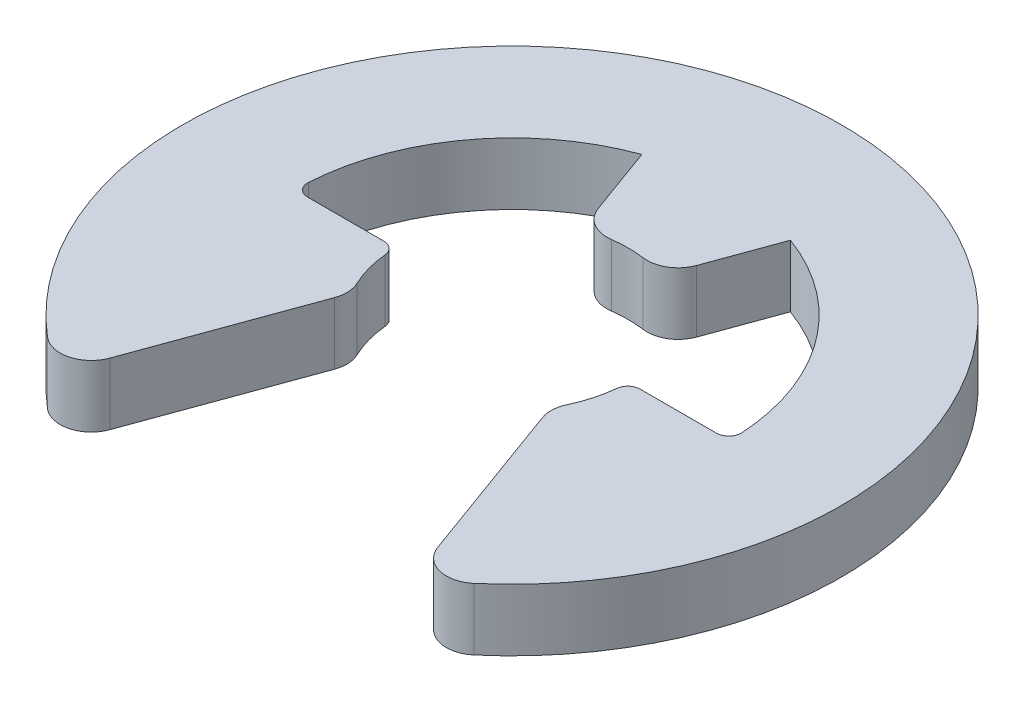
ISO-10303-21;
HEADER;
FILE_DESCRIPTION(('STEP AP214'),'2;1');
FILE_NAME('part.step','',(''),(''),'','','');
FILE_SCHEMA(('AUTOMOTIVE_DESIGN { 1 0 10303 214 1 1 1 1 }'));
ENDSEC;
DATA;
#1=APPLICATION_CONTEXT('core data for automotive mechanical design processes');
#2=APPLICATION_PROTOCOL_DEFINITION('international standard','automotive_design',2000,#1);
#3=PRODUCT_CONTEXT('',#1,'mechanical');
#4=PRODUCT('Part','Part','',(#3));
#5=PRODUCT_RELATED_PRODUCT_CATEGORY('part','',(#4));
#6=PRODUCT_DEFINITION_FORMATION('','',#4);
#7=PRODUCT_DEFINITION_CONTEXT('part definition',#1,'design');
#8=PRODUCT_DEFINITION('design','',#6,#7);
#9=PRODUCT_DEFINITION_SHAPE('','',#8);
#10=(LENGTH_UNIT() NAMED_UNIT(*) SI_UNIT(.MILLI.,.METRE.));
#11=(NAMED_UNIT(*) PLANE_ANGLE_UNIT() SI_UNIT($,.RADIAN.));
#12=(NAMED_UNIT(*) SI_UNIT($,.STERADIAN.) SOLID_ANGLE_UNIT());
#13=UNCERTAINTY_MEASURE_WITH_UNIT(LENGTH_MEASURE(1.E-05),#10,'distance_accuracy_value','');
#14=(GEOMETRIC_REPRESENTATION_CONTEXT(3) GLOBAL_UNCERTAINTY_ASSIGNED_CONTEXT((#13)) GLOBAL_UNIT_ASSIGNED_CONTEXT((#10,
#11,#12)) REPRESENTATION_CONTEXT('',''));
#15=CARTESIAN_POINT('',(0.,0.,0.));
#16=DIRECTION('',(0.,0.,1.));
#17=DIRECTION('',(1.,0.,0.));
#18=AXIS2_PLACEMENT_3D('',#15,#16,#17);
#19=CARTESIAN_POINT('',(0.,0.2,0.));
#20=DIRECTION('',(0.,-1.,0.));
#21=DIRECTION('',(0.,0.,-1.));
#22=AXIS2_PLACEMENT_3D('',#19,#20,#21);
#23=CYLINDRICAL_SURFACE('',#22,1.4);
#24=CARTESIAN_POINT('',(0.,0.2,0.));
#25=DIRECTION('',(0.,-1.,0.));
#26=DIRECTION('',(0.,0.,1.));
#27=AXIS2_PLACEMENT_3D('',#24,#25,#26);
#28=CIRCLE('',#27,1.4);
#29=CARTESIAN_POINT('',(-1.39742646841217,0.2,-0.0848484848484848));
#30=VERTEX_POINT('',#29);
#31=CARTESIAN_POINT('',(-0.478828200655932,0.2,-1.31556966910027));
#32=VERTEX_POINT('',#31);
#33=EDGE_CURVE('E187',#30,#32,#28,.T.);
#34=ORIENTED_EDGE('',*,*,#33,.F.);
#35=DIRECTION('',(0.,-1.,0.));
#36=VECTOR('',#35,1.);
#37=CARTESIAN_POINT('',(-1.39742646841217,0.2,-0.0848484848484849));
#38=LINE('',#37,#36);
#39=CARTESIAN_POINT('',(-1.39742646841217,-0.2,-0.0848484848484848));
#40=VERTEX_POINT('',#39);
#41=EDGE_CURVE('E327',#30,#40,#38,.T.);
#42=ORIENTED_EDGE('',*,*,#41,.T.);
#43=CARTESIAN_POINT('',(0.,-0.2,0.));
#44=DIRECTION('',(0.,-1.,0.));
#45=DIRECTION('',(0.,0.,1.));
#46=AXIS2_PLACEMENT_3D('',#43,#44,#45);
#47=CIRCLE('',#46,1.4);
#48=CARTESIAN_POINT('',(-0.478828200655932,-0.2,-1.31556966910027));
#49=VERTEX_POINT('',#48);
#50=EDGE_CURVE('E211',#40,#49,#47,.T.);
#51=ORIENTED_EDGE('',*,*,#50,.T.);
#52=DIRECTION('',(0.,-1.,0.));
#53=VECTOR('',#52,1.);
#54=CARTESIAN_POINT('',(-0.478828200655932,0.2,-1.31556966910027));
#55=LINE('',#54,#53);
#56=EDGE_CURVE('E204',#32,#49,#55,.T.);
#57=ORIENTED_EDGE('',*,*,#56,.F.);
#58=EDGE_LOOP('',(#34,#42,#51,#57));
#59=FACE_BOUND('',#58,.T.);
#60=ADVANCED_FACE('F39',(#59),#23,.F.);
#61=CARTESIAN_POINT('',(-0.478828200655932,0.2,-1.31556966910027));
#62=DIRECTION('',(0.939692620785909,0.,-0.342020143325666));
#63=DIRECTION('',(-0.342020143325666,0.,-0.939692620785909));
#64=AXIS2_PLACEMENT_3D('',#61,#62,#63);
#65=PLANE('',#64);
#66=DIRECTION('',(0.342020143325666,0.,0.939692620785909));
#67=VECTOR('',#66,1.);
#68=CARTESIAN_POINT('',(-0.478828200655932,-0.2,-1.31556966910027));
#69=LINE('',#68,#67);
#70=CARTESIAN_POINT('',(-0.31763711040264,-0.2,-0.872700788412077));
#71=VERTEX_POINT('',#70);
#72=EDGE_CURVE('E446',#49,#71,#69,.T.);
#73=ORIENTED_EDGE('',*,*,#72,.T.);
#74=DIRECTION('',(0.,-1.,0.));
#75=VECTOR('',#74,1.);
#76=CARTESIAN_POINT('',(-0.31763711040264,0.2,-0.872700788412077));
#77=LINE('',#76,#75);
#78=CARTESIAN_POINT('',(-0.31763711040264,0.2,-0.872700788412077));
#79=VERTEX_POINT('',#78);
#80=EDGE_CURVE('E206',#71,#79,#77,.F.);
#81=ORIENTED_EDGE('',*,*,#80,.T.);
#82=DIRECTION('',(0.342020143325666,0.,0.939692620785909));
#83=VECTOR('',#82,1.);
#84=CARTESIAN_POINT('',(-0.478828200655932,0.2,-1.31556966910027));
#85=LINE('',#84,#83);
#86=EDGE_CURVE('E191',#32,#79,#85,.T.);
#87=ORIENTED_EDGE('',*,*,#86,.F.);
#88=ORIENTED_EDGE('',*,*,#56,.T.);
#89=EDGE_LOOP('',(#73,#81,#87,#88));
#90=FACE_BOUND('',#89,.T.);
#91=ADVANCED_FACE('F203',(#90),#65,.F.);
#92=CARTESIAN_POINT('',(0.,0.2,0.));
#93=DIRECTION('',(0.,-1.,0.));
#94=DIRECTION('',(0.,0.,-1.));
#95=AXIS2_PLACEMENT_3D('',#92,#93,#94);
#96=CYLINDRICAL_SURFACE('',#95,0.75);
#97=CARTESIAN_POINT('',(0.,-0.2,0.));
#98=DIRECTION('',(0.,-1.,0.));
#99=DIRECTION('',(0.,0.,1.));
#100=AXIS2_PLACEMENT_3D('',#97,#98,#99);
#101=CIRCLE('',#100,0.75);
#102=CARTESIAN_POINT('',(-0.102393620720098,-0.2,-0.742977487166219));
#103=VERTEX_POINT('',#102);
#104=CARTESIAN_POINT('',(0.102393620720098,-0.2,-0.742977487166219));
#105=VERTEX_POINT('',#104);
#106=EDGE_CURVE('E449',#103,#105,#101,.T.);
#107=ORIENTED_EDGE('',*,*,#106,.T.);
#108=DIRECTION('',(0.,-1.,0.));
#109=VECTOR('',#108,1.);
#110=CARTESIAN_POINT('',(0.102393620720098,0.2,-0.742977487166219));
#111=LINE('',#110,#109);
#112=CARTESIAN_POINT('',(0.102393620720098,0.2,-0.742977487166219));
#113=VERTEX_POINT('',#112);
#114=EDGE_CURVE('E290',#105,#113,#111,.F.);
#115=ORIENTED_EDGE('',*,*,#114,.T.);
#116=CARTESIAN_POINT('',(0.,0.2,0.));
#117=DIRECTION('',(0.,-1.,0.));
#118=DIRECTION('',(0.,0.,1.));
#119=AXIS2_PLACEMENT_3D('',#116,#117,#118);
#120=CIRCLE('',#119,0.75);
#121=CARTESIAN_POINT('',(-0.102393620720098,0.2,-0.742977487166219));
#122=VERTEX_POINT('',#121);
#123=EDGE_CURVE('E208',#122,#113,#120,.T.);
#124=ORIENTED_EDGE('',*,*,#123,.F.);
#125=DIRECTION('',(0.,-1.,0.));
#126=VECTOR('',#125,1.);
#127=CARTESIAN_POINT('',(-0.102393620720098,0.2,-0.742977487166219));
#128=LINE('',#127,#126);
#129=EDGE_CURVE('E286',#122,#103,#128,.T.);
#130=ORIENTED_EDGE('',*,*,#129,.T.);
#131=EDGE_LOOP('',(#107,#115,#124,#130));
#132=FACE_BOUND('',#131,.T.);
#133=ADVANCED_FACE('F370',(#132),#96,.F.);
#134=CARTESIAN_POINT('',(0.256515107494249,0.2,-0.704769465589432));
#135=DIRECTION('',(-0.93969262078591,0.,-0.342020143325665));
#136=DIRECTION('',(-0.342020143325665,0.,0.93969262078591));
#137=AXIS2_PLACEMENT_3D('',#134,#135,#136);
#138=PLANE('',#137);
#139=DIRECTION('',(0.342020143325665,0.,-0.93969262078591));
#140=VECTOR('',#139,1.);
#141=CARTESIAN_POINT('',(0.256515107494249,0.2,-0.704769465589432));
#142=LINE('',#141,#140);
#143=CARTESIAN_POINT('',(0.31763711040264,0.2,-0.872700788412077));
#144=VERTEX_POINT('',#143);
#145=CARTESIAN_POINT('',(0.478828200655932,0.2,-1.31556966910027));
#146=VERTEX_POINT('',#145);
#147=EDGE_CURVE('E423',#144,#146,#142,.T.);
#148=ORIENTED_EDGE('',*,*,#147,.F.);
#149=DIRECTION('',(0.,-1.,0.));
#150=VECTOR('',#149,1.);
#151=CARTESIAN_POINT('',(0.31763711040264,0.2,-0.872700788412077));
#152=LINE('',#151,#150);
#153=CARTESIAN_POINT('',(0.31763711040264,-0.2,-0.872700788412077));
#154=VERTEX_POINT('',#153);
#155=EDGE_CURVE('E282',#144,#154,#152,.T.);
#156=ORIENTED_EDGE('',*,*,#155,.T.);
#157=DIRECTION('',(0.342020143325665,0.,-0.93969262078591));
#158=VECTOR('',#157,1.);
#159=CARTESIAN_POINT('',(0.256515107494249,-0.2,-0.704769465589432));
#160=LINE('',#159,#158);
#161=CARTESIAN_POINT('',(0.478828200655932,-0.2,-1.31556966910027));
#162=VERTEX_POINT('',#161);
#163=EDGE_CURVE('E453',#154,#162,#160,.T.);
#164=ORIENTED_EDGE('',*,*,#163,.T.);
#165=DIRECTION('',(0.,-1.,0.));
#166=VECTOR('',#165,1.);
#167=CARTESIAN_POINT('',(0.478828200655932,0.2,-1.31556966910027));
#168=LINE('',#167,#166);
#169=EDGE_CURVE('E215',#146,#162,#168,.T.);
#170=ORIENTED_EDGE('',*,*,#169,.F.);
#171=EDGE_LOOP('',(#148,#156,#164,#170));
#172=FACE_BOUND('',#171,.T.);
#173=ADVANCED_FACE('F527',(#172),#138,.F.);
#174=CARTESIAN_POINT('',(0.,0.2,0.));
#175=DIRECTION('',(0.,-1.,0.));
#176=DIRECTION('',(0.,0.,-1.));
#177=AXIS2_PLACEMENT_3D('',#174,#175,#176);
#178=CYLINDRICAL_SURFACE('',#177,1.4);
#179=CARTESIAN_POINT('',(0.,-0.2,0.));
#180=DIRECTION('',(0.,-1.,0.));
#181=DIRECTION('',(0.,0.,1.));
#182=AXIS2_PLACEMENT_3D('',#179,#180,#181);
#183=CIRCLE('',#182,1.4);
#184=CARTESIAN_POINT('',(1.39742646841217,-0.2,-0.0848484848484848));
#185=VERTEX_POINT('',#184);
#186=EDGE_CURVE('E456',#162,#185,#183,.T.);
#187=ORIENTED_EDGE('',*,*,#186,.T.);
#188=DIRECTION('',(0.,-1.,0.));
#189=VECTOR('',#188,1.);
#190=CARTESIAN_POINT('',(1.39742646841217,0.2,-0.0848484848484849));
#191=LINE('',#190,#189);
#192=CARTESIAN_POINT('',(1.39742646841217,0.2,-0.0848484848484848));
#193=VERTEX_POINT('',#192);
#194=EDGE_CURVE('E309',#185,#193,#191,.F.);
#195=ORIENTED_EDGE('',*,*,#194,.T.);
#196=CARTESIAN_POINT('',(0.,0.2,0.));
#197=DIRECTION('',(0.,-1.,0.));
#198=DIRECTION('',(0.,0.,1.));
#199=AXIS2_PLACEMENT_3D('',#196,#197,#198);
#200=CIRCLE('',#199,1.4);
#201=EDGE_CURVE('E410',#146,#193,#200,.T.);
#202=ORIENTED_EDGE('',*,*,#201,.F.);
#203=ORIENTED_EDGE('',*,*,#169,.T.);
#204=EDGE_LOOP('',(#187,#195,#202,#203));
#205=FACE_BOUND('',#204,.T.);
#206=ADVANCED_FACE('F521',(#205),#178,.F.);
#207=CARTESIAN_POINT('',(0.75,0.2,0.));
#208=DIRECTION('',(0.,0.,1.));
#209=DIRECTION('',(1.,0.,0.));
#210=AXIS2_PLACEMENT_3D('',#207,#208,#209);
#211=PLANE('',#210);
#212=DIRECTION('',(-1.,0.,0.));
#213=VECTOR('',#212,1.);
#214=CARTESIAN_POINT('',(0.75,0.2,0.));
#215=LINE('',#214,#213);
#216=CARTESIAN_POINT('',(1.31757352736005,0.2,0.));
#217=VERTEX_POINT('',#216);
#218=CARTESIAN_POINT('',(0.826135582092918,0.2,0.));
#219=VERTEX_POINT('',#218);
#220=EDGE_CURVE('E407',#217,#219,#215,.T.);
#221=ORIENTED_EDGE('',*,*,#220,.F.);
#222=DIRECTION('',(0.,1.,0.));
#223=VECTOR('',#222,1.);
#224=CARTESIAN_POINT('',(1.31757352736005,-0.2,0.));
#225=LINE('',#224,#223);
#226=CARTESIAN_POINT('',(1.31757352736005,-0.2,0.));
#227=VERTEX_POINT('',#226);
#228=EDGE_CURVE('E305',#217,#227,#225,.F.);
#229=ORIENTED_EDGE('',*,*,#228,.T.);
#230=DIRECTION('',(-1.,0.,0.));
#231=VECTOR('',#230,1.);
#232=CARTESIAN_POINT('',(0.75,-0.2,0.));
#233=LINE('',#232,#231);
#234=CARTESIAN_POINT('',(0.826135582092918,-0.2,0.));
#235=VERTEX_POINT('',#234);
#236=EDGE_CURVE('E460',#227,#235,#233,.T.);
#237=ORIENTED_EDGE('',*,*,#236,.T.);
#238=DIRECTION('',(0.,-1.,0.));
#239=VECTOR('',#238,1.);
#240=CARTESIAN_POINT('',(0.826135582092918,0.2,0.));
#241=LINE('',#240,#239);
#242=EDGE_CURVE('E302',#235,#219,#241,.F.);
#243=ORIENTED_EDGE('',*,*,#242,.T.);
#244=EDGE_LOOP('',(#221,#229,#237,#243));
#245=FACE_BOUND('',#244,.T.);
#246=ADVANCED_FACE('F412',(#245),#211,.F.);
#247=CARTESIAN_POINT('',(0.,0.2,0.));
#248=DIRECTION('',(0.,-1.,0.));
#249=DIRECTION('',(0.,0.,-1.));
#250=AXIS2_PLACEMENT_3D('',#247,#248,#249);
#251=CYLINDRICAL_SURFACE('',#250,0.750000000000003);
#252=CARTESIAN_POINT('',(0.,0.2,0.));
#253=DIRECTION('',(0.,-1.,0.));
#254=DIRECTION('',(0.,0.,1.));
#255=AXIS2_PLACEMENT_3D('',#252,#253,#254);
#256=CIRCLE('',#255,0.750000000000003);
#257=CARTESIAN_POINT('',(0.746508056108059,0.2,0.072289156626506));
#258=VERTEX_POINT('',#257);
#259=CARTESIAN_POINT('',(0.677796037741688,0.2,0.321080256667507));
#260=VERTEX_POINT('',#259);
#261=EDGE_CURVE('E417',#258,#260,#256,.T.);
#262=ORIENTED_EDGE('',*,*,#261,.F.);
#263=DIRECTION('',(0.,-1.,0.));
#264=VECTOR('',#263,1.);
#265=CARTESIAN_POINT('',(0.746508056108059,0.2,0.072289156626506));
#266=LINE('',#265,#264);
#267=CARTESIAN_POINT('',(0.746508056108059,-0.2,0.072289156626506));
#268=VERTEX_POINT('',#267);
#269=EDGE_CURVE('E312',#258,#268,#266,.T.);
#270=ORIENTED_EDGE('',*,*,#269,.T.);
#271=CARTESIAN_POINT('',(0.,-0.2,0.));
#272=DIRECTION('',(0.,-1.,0.));
#273=DIRECTION('',(0.,0.,1.));
#274=AXIS2_PLACEMENT_3D('',#271,#272,#273);
#275=CIRCLE('',#274,0.750000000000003);
#276=CARTESIAN_POINT('',(0.677796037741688,-0.2,0.321080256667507));
#277=VERTEX_POINT('',#276);
#278=EDGE_CURVE('E463',#268,#277,#275,.T.);
#279=ORIENTED_EDGE('',*,*,#278,.T.);
#280=DIRECTION('',(0.,-1.,0.));
#281=VECTOR('',#280,1.);
#282=CARTESIAN_POINT('',(0.677796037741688,0.2,0.321080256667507));
#283=LINE('',#282,#281);
#284=EDGE_CURVE('E250',#277,#260,#283,.F.);
#285=ORIENTED_EDGE('',*,*,#284,.T.);
#286=EDGE_LOOP('',(#262,#270,#279,#285));
#287=FACE_BOUND('',#286,.T.);
#288=ADVANCED_FACE('F512',(#287),#251,.F.);
#289=CARTESIAN_POINT('',(0.639999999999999,0.2,0.391024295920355));
#290=DIRECTION('',(0.939692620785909,0.,-0.342020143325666));
#291=DIRECTION('',(-0.342020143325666,0.,-0.939692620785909));
#292=AXIS2_PLACEMENT_3D('',#289,#290,#291);
#293=PLANE('',#292);
#294=DIRECTION('',(0.342020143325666,0.,0.939692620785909));
#295=VECTOR('',#294,1.);
#296=CARTESIAN_POINT('',(0.639999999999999,0.2,0.391024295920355));
#297=LINE('',#296,#295);
#298=CARTESIAN_POINT('',(0.670603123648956,0.2,0.475105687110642));
#299=VERTEX_POINT('',#298);
#300=CARTESIAN_POINT('',(1.05698051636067,0.2,1.53666884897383));
#301=VERTEX_POINT('',#300);
#302=EDGE_CURVE('E420',#299,#301,#297,.T.);
#303=ORIENTED_EDGE('',*,*,#302,.F.);
#304=DIRECTION('',(0.,-1.,0.));
#305=VECTOR('',#304,1.);
#306=CARTESIAN_POINT('',(0.670603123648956,0.2,0.475105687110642));
#307=LINE('',#306,#305);
#308=CARTESIAN_POINT('',(0.670603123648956,-0.2,0.475105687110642));
#309=VERTEX_POINT('',#308);
#310=EDGE_CURVE('E220',#299,#309,#307,.T.);
#311=ORIENTED_EDGE('',*,*,#310,.T.);
#312=DIRECTION('',(0.342020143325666,0.,0.939692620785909));
#313=VECTOR('',#312,1.);
#314=CARTESIAN_POINT('',(0.639999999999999,-0.2,0.391024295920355));
#315=LINE('',#314,#313);
#316=CARTESIAN_POINT('',(1.05698051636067,-0.2,1.53666884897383));
#317=VERTEX_POINT('',#316);
#318=EDGE_CURVE('E466',#309,#317,#315,.T.);
#319=ORIENTED_EDGE('',*,*,#318,.T.);
#320=DIRECTION('',(0.,-1.,0.));
#321=VECTOR('',#320,1.);
#322=CARTESIAN_POINT('',(1.05698051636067,0.2,1.53666884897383));
#323=LINE('',#322,#321);
#324=EDGE_CURVE('E214',#317,#301,#323,.F.);
#325=ORIENTED_EDGE('',*,*,#324,.T.);
#326=EDGE_LOOP('',(#303,#311,#319,#325));
#327=FACE_BOUND('',#326,.T.);
#328=ADVANCED_FACE('F506',(#327),#293,.F.);
#329=CARTESIAN_POINT('',(0.,0.2,0.));
#330=DIRECTION('',(0.,-1.,0.));
#331=DIRECTION('',(0.,0.,-1.));
#332=AXIS2_PLACEMENT_3D('',#329,#330,#331);
#333=CYLINDRICAL_SURFACE('',#332,2.125);
#334=CARTESIAN_POINT('',(0.,0.2,0.));
#335=DIRECTION('',(0.,1.,0.));
#336=DIRECTION('',(0.,0.,1.));
#337=AXIS2_PLACEMENT_3D('',#334,#335,#336);
#338=CIRCLE('',#337,2.125);
#339=CARTESIAN_POINT('',(1.37426127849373,0.2,1.62081181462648));
#340=VERTEX_POINT('',#339);
#341=CARTESIAN_POINT('',(-1.37426127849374,0.2,1.62081181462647));
#342=VERTEX_POINT('',#341);
#343=EDGE_CURVE('E430',#340,#342,#338,.T.);
#344=ORIENTED_EDGE('',*,*,#343,.F.);
#345=DIRECTION('',(0.,-1.,0.));
#346=VECTOR('',#345,1.);
#347=CARTESIAN_POINT('',(1.37426127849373,0.2,1.62081181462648));
#348=LINE('',#347,#346);
#349=CARTESIAN_POINT('',(1.37426127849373,-0.2,1.62081181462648));
#350=VERTEX_POINT('',#349);
#351=EDGE_CURVE('E298',#340,#350,#348,.T.);
#352=ORIENTED_EDGE('',*,*,#351,.T.);
#353=CARTESIAN_POINT('',(0.,-0.2,0.));
#354=DIRECTION('',(0.,1.,0.));
#355=DIRECTION('',(0.,0.,1.));
#356=AXIS2_PLACEMENT_3D('',#353,#354,#355);
#357=CIRCLE('',#356,2.125);
#358=CARTESIAN_POINT('',(-1.37426127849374,-0.2,1.62081181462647));
#359=VERTEX_POINT('',#358);
#360=EDGE_CURVE('E470',#350,#359,#357,.T.);
#361=ORIENTED_EDGE('',*,*,#360,.T.);
#362=DIRECTION('',(0.,-1.,0.));
#363=VECTOR('',#362,1.);
#364=CARTESIAN_POINT('',(-1.37426127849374,0.2,1.62081181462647));
#365=LINE('',#364,#363);
#366=EDGE_CURVE('E295',#359,#342,#365,.F.);
#367=ORIENTED_EDGE('',*,*,#366,.T.);
#368=EDGE_LOOP('',(#344,#352,#361,#367));
#369=FACE_BOUND('',#368,.T.);
#370=ADVANCED_FACE('F499',(#369),#333,.T.);
#371=CARTESIAN_POINT('',(-1.14843498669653,0.2,1.78793794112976));
#372=DIRECTION('',(-0.939692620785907,0.,-0.342020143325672));
#373=DIRECTION('',(-0.342020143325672,0.,0.939692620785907));
#374=AXIS2_PLACEMENT_3D('',#371,#372,#373);
#375=PLANE('',#374);
#376=DIRECTION('',(0.342020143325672,0.,-0.939692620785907));
#377=VECTOR('',#376,1.);
#378=CARTESIAN_POINT('',(-1.14843498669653,-0.2,1.78793794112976));
#379=LINE('',#378,#377);
#380=CARTESIAN_POINT('',(-1.05698051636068,-0.2,1.53666884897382));
#381=VERTEX_POINT('',#380);
#382=CARTESIAN_POINT('',(-0.670603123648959,-0.2,0.475105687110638));
#383=VERTEX_POINT('',#382);
#384=EDGE_CURVE('E474',#381,#383,#379,.T.);
#385=ORIENTED_EDGE('',*,*,#384,.T.);
#386=DIRECTION('',(0.,-1.,0.));
#387=VECTOR('',#386,1.);
#388=CARTESIAN_POINT('',(-0.670603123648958,0.2,0.475105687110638));
#389=LINE('',#388,#387);
#390=CARTESIAN_POINT('',(-0.670603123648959,0.2,0.475105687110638));
#391=VERTEX_POINT('',#390);
#392=EDGE_CURVE('E279',#383,#391,#389,.F.);
#393=ORIENTED_EDGE('',*,*,#392,.T.);
#394=DIRECTION('',(0.342020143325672,0.,-0.939692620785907));
#395=VECTOR('',#394,1.);
#396=CARTESIAN_POINT('',(-1.14843498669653,0.2,1.78793794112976));
#397=LINE('',#396,#395);
#398=CARTESIAN_POINT('',(-1.05698051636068,0.2,1.53666884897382));
#399=VERTEX_POINT('',#398);
#400=EDGE_CURVE('E434',#399,#391,#397,.T.);
#401=ORIENTED_EDGE('',*,*,#400,.F.);
#402=DIRECTION('',(0.,-1.,0.));
#403=VECTOR('',#402,1.);
#404=CARTESIAN_POINT('',(-1.05698051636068,0.2,1.53666884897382));
#405=LINE('',#404,#403);
#406=EDGE_CURVE('E275',#399,#381,#405,.T.);
#407=ORIENTED_EDGE('',*,*,#406,.T.);
#408=EDGE_LOOP('',(#385,#393,#401,#407));
#409=FACE_BOUND('',#408,.T.);
#410=ADVANCED_FACE('F491',(#409),#375,.F.);
#411=CARTESIAN_POINT('',(0.,0.2,0.));
#412=DIRECTION('',(0.,-1.,0.));
#413=DIRECTION('',(0.,0.,-1.));
#414=AXIS2_PLACEMENT_3D('',#411,#412,#413);
#415=CYLINDRICAL_SURFACE('',#414,0.750000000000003);
#416=CARTESIAN_POINT('',(0.,-0.2,0.));
#417=DIRECTION('',(0.,-1.,0.));
#418=DIRECTION('',(0.,0.,1.));
#419=AXIS2_PLACEMENT_3D('',#416,#417,#418);
#420=CIRCLE('',#419,0.750000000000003);
#421=CARTESIAN_POINT('',(-0.67779603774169,-0.2,0.321080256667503));
#422=VERTEX_POINT('',#421);
#423=CARTESIAN_POINT('',(-0.746508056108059,-0.2,0.072289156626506));
#424=VERTEX_POINT('',#423);
#425=EDGE_CURVE('E353',#422,#424,#420,.T.);
#426=ORIENTED_EDGE('',*,*,#425,.T.);
#427=DIRECTION('',(0.,-1.,0.));
#428=VECTOR('',#427,1.);
#429=CARTESIAN_POINT('',(-0.746508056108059,0.2,0.072289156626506));
#430=LINE('',#429,#428);
#431=CARTESIAN_POINT('',(-0.746508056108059,0.2,0.072289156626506));
#432=VERTEX_POINT('',#431);
#433=EDGE_CURVE('E336',#424,#432,#430,.F.);
#434=ORIENTED_EDGE('',*,*,#433,.T.);
#435=CARTESIAN_POINT('',(0.,0.2,0.));
#436=DIRECTION('',(0.,-1.,0.));
#437=DIRECTION('',(0.,0.,1.));
#438=AXIS2_PLACEMENT_3D('',#435,#436,#437);
#439=CIRCLE('',#438,0.750000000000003);
#440=CARTESIAN_POINT('',(-0.67779603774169,0.2,0.321080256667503));
#441=VERTEX_POINT('',#440);
#442=EDGE_CURVE('E438',#441,#432,#439,.T.);
#443=ORIENTED_EDGE('',*,*,#442,.F.);
#444=DIRECTION('',(0.,-1.,0.));
#445=VECTOR('',#444,1.);
#446=CARTESIAN_POINT('',(-0.67779603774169,0.2,0.321080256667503));
#447=LINE('',#446,#445);
#448=EDGE_CURVE('E271',#441,#422,#447,.T.);
#449=ORIENTED_EDGE('',*,*,#448,.T.);
#450=EDGE_LOOP('',(#426,#434,#443,#449));
#451=FACE_BOUND('',#450,.T.);
#452=ADVANCED_FACE('F483',(#451),#415,.F.);
#453=CARTESIAN_POINT('',(-0.75,0.2,0.));
#454=DIRECTION('',(0.,0.,1.));
#455=DIRECTION('',(1.,0.,0.));
#456=AXIS2_PLACEMENT_3D('',#453,#454,#455);
#457=PLANE('',#456);
#458=DIRECTION('',(-1.,0.,0.));
#459=VECTOR('',#458,1.);
#460=CARTESIAN_POINT('',(-0.75,-0.2,0.));
#461=LINE('',#460,#459);
#462=CARTESIAN_POINT('',(-0.826135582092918,-0.2,0.));
#463=VERTEX_POINT('',#462);
#464=CARTESIAN_POINT('',(-1.31757352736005,-0.2,0.));
#465=VERTEX_POINT('',#464);
#466=EDGE_CURVE('E198',#463,#465,#461,.T.);
#467=ORIENTED_EDGE('',*,*,#466,.T.);
#468=DIRECTION('',(0.,1.,0.));
#469=VECTOR('',#468,1.);
#470=CARTESIAN_POINT('',(-1.31757352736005,0.2,0.));
#471=LINE('',#470,#469);
#472=CARTESIAN_POINT('',(-1.31757352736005,0.2,0.));
#473=VERTEX_POINT('',#472);
#474=EDGE_CURVE('E61',#465,#473,#471,.T.);
#475=ORIENTED_EDGE('',*,*,#474,.T.);
#476=DIRECTION('',(-1.,0.,0.));
#477=VECTOR('',#476,1.);
#478=CARTESIAN_POINT('',(-0.75,0.2,0.));
#479=LINE('',#478,#477);
#480=CARTESIAN_POINT('',(-0.826135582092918,0.2,0.));
#481=VERTEX_POINT('',#480);
#482=EDGE_CURVE('E224',#481,#473,#479,.T.);
#483=ORIENTED_EDGE('',*,*,#482,.F.);
#484=DIRECTION('',(0.,-1.,0.));
#485=VECTOR('',#484,1.);
#486=CARTESIAN_POINT('',(-0.826135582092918,0.2,0.));
#487=LINE('',#486,#485);
#488=EDGE_CURVE('E330',#481,#463,#487,.T.);
#489=ORIENTED_EDGE('',*,*,#488,.T.);
#490=EDGE_LOOP('',(#467,#475,#483,#489));
#491=FACE_BOUND('',#490,.T.);
#492=ADVANCED_FACE('F350',(#491),#457,.F.);
#493=CARTESIAN_POINT('',(0.,0.2,0.));
#494=DIRECTION('',(0.,1.,0.));
#495=DIRECTION('',(0.,0.,1.));
#496=AXIS2_PLACEMENT_3D('',#493,#494,#495);
#497=PLANE('',#496);
#498=ORIENTED_EDGE('',*,*,#220,.T.);
#499=CARTESIAN_POINT('',(0.826135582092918,0.2,0.08));
#500=DIRECTION('',(0.,1.,0.));
#501=DIRECTION('',(0.,0.,1.));
#502=AXIS2_PLACEMENT_3D('',#499,#500,#501);
#503=CIRCLE('',#502,0.08);
#504=EDGE_CURVE('E324',#219,#258,#503,.T.);
#505=ORIENTED_EDGE('',*,*,#504,.T.);
#506=ORIENTED_EDGE('',*,*,#261,.T.);
#507=CARTESIAN_POINT('',(0.858541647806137,0.2,0.406701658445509));
#508=DIRECTION('',(0.,1.,0.));
#509=DIRECTION('',(0.,0.,1.));
#510=AXIS2_PLACEMENT_3D('',#507,#508,#509);
#511=CIRCLE('',#510,0.2);
#512=EDGE_CURVE('E268',#260,#299,#511,.T.);
#513=ORIENTED_EDGE('',*,*,#512,.T.);
#514=ORIENTED_EDGE('',*,*,#302,.T.);
#515=CARTESIAN_POINT('',(1.24491904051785,0.2,1.46826482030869));
#516=DIRECTION('',(0.,1.,0.));
#517=DIRECTION('',(0.,0.,1.));
#518=AXIS2_PLACEMENT_3D('',#515,#516,#517);
#519=CIRCLE('',#518,0.2);
#520=EDGE_CURVE('E257',#301,#340,#519,.T.);
#521=ORIENTED_EDGE('',*,*,#520,.T.);
#522=ORIENTED_EDGE('',*,*,#343,.T.);
#523=CARTESIAN_POINT('',(-1.24491904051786,0.2,1.46826482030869));
#524=DIRECTION('',(0.,1.,0.));
#525=DIRECTION('',(0.,0.,1.));
#526=AXIS2_PLACEMENT_3D('',#523,#524,#525);
#527=CIRCLE('',#526,0.2);
#528=EDGE_CURVE('E254',#342,#399,#527,.T.);
#529=ORIENTED_EDGE('',*,*,#528,.T.);
#530=ORIENTED_EDGE('',*,*,#400,.T.);
#531=CARTESIAN_POINT('',(-0.85854164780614,0.2,0.406701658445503));
#532=DIRECTION('',(0.,1.,0.));
#533=DIRECTION('',(0.,0.,1.));
#534=AXIS2_PLACEMENT_3D('',#531,#532,#533);
#535=CIRCLE('',#534,0.2);
#536=EDGE_CURVE('E265',#391,#441,#535,.T.);
#537=ORIENTED_EDGE('',*,*,#536,.T.);
#538=ORIENTED_EDGE('',*,*,#442,.T.);
#539=CARTESIAN_POINT('',(-0.826135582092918,0.2,0.08));
#540=DIRECTION('',(0.,1.,0.));
#541=DIRECTION('',(0.,0.,1.));
#542=AXIS2_PLACEMENT_3D('',#539,#540,#541);
#543=CIRCLE('',#542,0.08);
#544=EDGE_CURVE('E321',#432,#481,#543,.T.);
#545=ORIENTED_EDGE('',*,*,#544,.T.);
#546=ORIENTED_EDGE('',*,*,#482,.T.);
#547=CARTESIAN_POINT('',(-1.31757352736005,0.2,-0.08));
#548=DIRECTION('',(0.,1.,0.));
#549=DIRECTION('',(0.,0.,1.));
#550=AXIS2_PLACEMENT_3D('',#547,#548,#549);
#551=CIRCLE('',#550,0.08);
#552=EDGE_CURVE('E11',#473,#30,#551,.F.);
#553=ORIENTED_EDGE('',*,*,#552,.T.);
#554=ORIENTED_EDGE('',*,*,#33,.T.);
#555=ORIENTED_EDGE('',*,*,#86,.T.);
#556=CARTESIAN_POINT('',(-0.129698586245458,0.2,-0.94110481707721));
#557=DIRECTION('',(0.,1.,0.));
#558=DIRECTION('',(0.,0.,1.));
#559=AXIS2_PLACEMENT_3D('',#556,#557,#558);
#560=CIRCLE('',#559,0.2);
#561=EDGE_CURVE('E259',#79,#122,#560,.T.);
#562=ORIENTED_EDGE('',*,*,#561,.T.);
#563=ORIENTED_EDGE('',*,*,#123,.T.);
#564=CARTESIAN_POINT('',(0.129698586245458,0.2,-0.94110481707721));
#565=DIRECTION('',(0.,1.,0.));
#566=DIRECTION('',(0.,0.,1.));
#567=AXIS2_PLACEMENT_3D('',#564,#565,#566);
#568=CIRCLE('',#567,0.2);
#569=EDGE_CURVE('E262',#113,#144,#568,.T.);
#570=ORIENTED_EDGE('',*,*,#569,.T.);
#571=ORIENTED_EDGE('',*,*,#147,.T.);
#572=ORIENTED_EDGE('',*,*,#201,.T.);
#573=CARTESIAN_POINT('',(1.31757352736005,0.2,-0.08));
#574=DIRECTION('',(0.,1.,0.));
#575=DIRECTION('',(0.,0.,1.));
#576=AXIS2_PLACEMENT_3D('',#573,#574,#575);
#577=CIRCLE('',#576,0.08);
#578=EDGE_CURVE('E342',#193,#217,#577,.F.);
#579=ORIENTED_EDGE('',*,*,#578,.T.);
#580=EDGE_LOOP('',(#498,#505,#506,#513,#514,#521,#522,#529,#530,#537,#538,#545,#546,#553,#554,
#555,#562,#563,#570,#571,#572,#579));
#581=FACE_BOUND('',#580,.T.);
#582=ADVANCED_FACE('F190',(#581),#497,.T.);
#583=CARTESIAN_POINT('',(0.,-0.2,0.));
#584=DIRECTION('',(0.,1.,0.));
#585=DIRECTION('',(0.,0.,1.));
#586=AXIS2_PLACEMENT_3D('',#583,#584,#585);
#587=PLANE('',#586);
#588=ORIENTED_EDGE('',*,*,#278,.F.);
#589=CARTESIAN_POINT('',(0.826135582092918,-0.2,0.08));
#590=DIRECTION('',(0.,1.,0.));
#591=DIRECTION('',(0.,0.,1.));
#592=AXIS2_PLACEMENT_3D('',#589,#590,#591);
#593=CIRCLE('',#592,0.08);
#594=EDGE_CURVE('E318',#268,#235,#593,.F.);
#595=ORIENTED_EDGE('',*,*,#594,.T.);
#596=ORIENTED_EDGE('',*,*,#236,.F.);
#597=CARTESIAN_POINT('',(1.31757352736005,-0.2,-0.08));
#598=DIRECTION('',(0.,1.,0.));
#599=DIRECTION('',(0.,0.,1.));
#600=AXIS2_PLACEMENT_3D('',#597,#598,#599);
#601=CIRCLE('',#600,0.08);
#602=EDGE_CURVE('E339',#227,#185,#601,.T.);
#603=ORIENTED_EDGE('',*,*,#602,.T.);
#604=ORIENTED_EDGE('',*,*,#186,.F.);
#605=ORIENTED_EDGE('',*,*,#163,.F.);
#606=CARTESIAN_POINT('',(0.129698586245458,-0.2,-0.94110481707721));
#607=DIRECTION('',(0.,1.,0.));
#608=DIRECTION('',(0.,0.,1.));
#609=AXIS2_PLACEMENT_3D('',#606,#607,#608);
#610=CIRCLE('',#609,0.2);
#611=EDGE_CURVE('E240',#154,#105,#610,.F.);
#612=ORIENTED_EDGE('',*,*,#611,.T.);
#613=ORIENTED_EDGE('',*,*,#106,.F.);
#614=CARTESIAN_POINT('',(-0.129698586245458,-0.2,-0.94110481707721));
#615=DIRECTION('',(0.,1.,0.));
#616=DIRECTION('',(0.,0.,1.));
#617=AXIS2_PLACEMENT_3D('',#614,#615,#616);
#618=CIRCLE('',#617,0.2);
#619=EDGE_CURVE('E237',#103,#71,#618,.F.);
#620=ORIENTED_EDGE('',*,*,#619,.T.);
#621=ORIENTED_EDGE('',*,*,#72,.F.);
#622=ORIENTED_EDGE('',*,*,#50,.F.);
#623=CARTESIAN_POINT('',(-1.31757352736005,-0.2,-0.08));
#624=DIRECTION('',(0.,1.,0.));
#625=DIRECTION('',(0.,0.,1.));
#626=AXIS2_PLACEMENT_3D('',#623,#624,#625);
#627=CIRCLE('',#626,0.08);
#628=EDGE_CURVE('E48',#40,#465,#627,.T.);
#629=ORIENTED_EDGE('',*,*,#628,.T.);
#630=ORIENTED_EDGE('',*,*,#466,.F.);
#631=CARTESIAN_POINT('',(-0.826135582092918,-0.2,0.08));
#632=DIRECTION('',(0.,1.,0.));
#633=DIRECTION('',(0.,0.,1.));
#634=AXIS2_PLACEMENT_3D('',#631,#632,#633);
#635=CIRCLE('',#634,0.08);
#636=EDGE_CURVE('E316',#463,#424,#635,.F.);
#637=ORIENTED_EDGE('',*,*,#636,.T.);
#638=ORIENTED_EDGE('',*,*,#425,.F.);
#639=CARTESIAN_POINT('',(-0.85854164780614,-0.2,0.406701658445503));
#640=DIRECTION('',(0.,1.,0.));
#641=DIRECTION('',(0.,0.,1.));
#642=AXIS2_PLACEMENT_3D('',#639,#640,#641);
#643=CIRCLE('',#642,0.2);
#644=EDGE_CURVE('E243',#422,#383,#643,.F.);
#645=ORIENTED_EDGE('',*,*,#644,.T.);
#646=ORIENTED_EDGE('',*,*,#384,.F.);
#647=CARTESIAN_POINT('',(-1.24491904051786,-0.2,1.46826482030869));
#648=DIRECTION('',(0.,1.,0.));
#649=DIRECTION('',(0.,0.,1.));
#650=AXIS2_PLACEMENT_3D('',#647,#648,#649);
#651=CIRCLE('',#650,0.2);
#652=EDGE_CURVE('E231',#381,#359,#651,.F.);
#653=ORIENTED_EDGE('',*,*,#652,.T.);
#654=ORIENTED_EDGE('',*,*,#360,.F.);
#655=CARTESIAN_POINT('',(1.24491904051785,-0.2,1.46826482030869));
#656=DIRECTION('',(0.,1.,0.));
#657=DIRECTION('',(0.,0.,1.));
#658=AXIS2_PLACEMENT_3D('',#655,#656,#657);
#659=CIRCLE('',#658,0.2);
#660=EDGE_CURVE('E234',#350,#317,#659,.F.);
#661=ORIENTED_EDGE('',*,*,#660,.T.);
#662=ORIENTED_EDGE('',*,*,#318,.F.);
#663=CARTESIAN_POINT('',(0.858541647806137,-0.2,0.406701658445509));
#664=DIRECTION('',(0.,1.,0.));
#665=DIRECTION('',(0.,0.,1.));
#666=AXIS2_PLACEMENT_3D('',#663,#664,#665);
#667=CIRCLE('',#666,0.2);
#668=EDGE_CURVE('E246',#309,#277,#667,.F.);
#669=ORIENTED_EDGE('',*,*,#668,.T.);
#670=EDGE_LOOP('',(#588,#595,#596,#603,#604,#605,#612,#613,#620,#621,#622,#629,#630,#637,#638,
#645,#646,#653,#654,#661,#662,#669));
#671=FACE_BOUND('',#670,.T.);
#672=ADVANCED_FACE('F348',(#671),#587,.F.);
#673=CARTESIAN_POINT('',(0.858541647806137,0.2,0.406701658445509));
#674=DIRECTION('',(0.,-1.,0.));
#675=DIRECTION('',(0.,0.,-1.));
#676=AXIS2_PLACEMENT_3D('',#673,#674,#675);
#677=CYLINDRICAL_SURFACE('',#676,0.2);
#678=ORIENTED_EDGE('',*,*,#512,.F.);
#679=ORIENTED_EDGE('',*,*,#284,.F.);
#680=ORIENTED_EDGE('',*,*,#668,.F.);
#681=ORIENTED_EDGE('',*,*,#310,.F.);
#682=EDGE_LOOP('',(#678,#679,#680,#681));
#683=FACE_BOUND('',#682,.T.);
#684=ADVANCED_FACE('F374',(#683),#677,.T.);
#685=CARTESIAN_POINT('',(-0.85854164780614,0.2,0.406701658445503));
#686=DIRECTION('',(0.,-1.,0.));
#687=DIRECTION('',(0.,0.,-1.));
#688=AXIS2_PLACEMENT_3D('',#685,#686,#687);
#689=CYLINDRICAL_SURFACE('',#688,0.2);
#690=ORIENTED_EDGE('',*,*,#536,.F.);
#691=ORIENTED_EDGE('',*,*,#392,.F.);
#692=ORIENTED_EDGE('',*,*,#644,.F.);
#693=ORIENTED_EDGE('',*,*,#448,.F.);
#694=EDGE_LOOP('',(#690,#691,#692,#693));
#695=FACE_BOUND('',#694,.T.);
#696=ADVANCED_FACE('F377',(#695),#689,.T.);
#697=CARTESIAN_POINT('',(0.129698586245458,0.2,-0.94110481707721));
#698=DIRECTION('',(0.,-1.,0.));
#699=DIRECTION('',(0.,0.,-1.));
#700=AXIS2_PLACEMENT_3D('',#697,#698,#699);
#701=CYLINDRICAL_SURFACE('',#700,0.2);
#702=ORIENTED_EDGE('',*,*,#569,.F.);
#703=ORIENTED_EDGE('',*,*,#114,.F.);
#704=ORIENTED_EDGE('',*,*,#611,.F.);
#705=ORIENTED_EDGE('',*,*,#155,.F.);
#706=EDGE_LOOP('',(#702,#703,#704,#705));
#707=FACE_BOUND('',#706,.T.);
#708=ADVANCED_FACE('F381',(#707),#701,.T.);
#709=CARTESIAN_POINT('',(-0.129698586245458,0.2,-0.94110481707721));
#710=DIRECTION('',(0.,-1.,0.));
#711=DIRECTION('',(0.,0.,-1.));
#712=AXIS2_PLACEMENT_3D('',#709,#710,#711);
#713=CYLINDRICAL_SURFACE('',#712,0.2);
#714=ORIENTED_EDGE('',*,*,#561,.F.);
#715=ORIENTED_EDGE('',*,*,#80,.F.);
#716=ORIENTED_EDGE('',*,*,#619,.F.);
#717=ORIENTED_EDGE('',*,*,#129,.F.);
#718=EDGE_LOOP('',(#714,#715,#716,#717));
#719=FACE_BOUND('',#718,.T.);
#720=ADVANCED_FACE('F385',(#719),#713,.T.);
#721=CARTESIAN_POINT('',(1.24491904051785,0.2,1.46826482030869));
#722=DIRECTION('',(0.,-1.,0.));
#723=DIRECTION('',(0.,0.,-1.));
#724=AXIS2_PLACEMENT_3D('',#721,#722,#723);
#725=CYLINDRICAL_SURFACE('',#724,0.2);
#726=ORIENTED_EDGE('',*,*,#520,.F.);
#727=ORIENTED_EDGE('',*,*,#324,.F.);
#728=ORIENTED_EDGE('',*,*,#660,.F.);
#729=ORIENTED_EDGE('',*,*,#351,.F.);
#730=EDGE_LOOP('',(#726,#727,#728,#729));
#731=FACE_BOUND('',#730,.T.);
#732=ADVANCED_FACE('F389',(#731),#725,.T.);
#733=CARTESIAN_POINT('',(-1.24491904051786,0.2,1.46826482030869));
#734=DIRECTION('',(0.,-1.,0.));
#735=DIRECTION('',(0.,0.,-1.));
#736=AXIS2_PLACEMENT_3D('',#733,#734,#735);
#737=CYLINDRICAL_SURFACE('',#736,0.2);
#738=ORIENTED_EDGE('',*,*,#528,.F.);
#739=ORIENTED_EDGE('',*,*,#366,.F.);
#740=ORIENTED_EDGE('',*,*,#652,.F.);
#741=ORIENTED_EDGE('',*,*,#406,.F.);
#742=EDGE_LOOP('',(#738,#739,#740,#741));
#743=FACE_BOUND('',#742,.T.);
#744=ADVANCED_FACE('F393',(#743),#737,.T.);
#745=CARTESIAN_POINT('',(1.31757352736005,0.2,-0.08));
#746=DIRECTION('',(0.,-1.,0.));
#747=DIRECTION('',(0.,0.,-1.));
#748=AXIS2_PLACEMENT_3D('',#745,#746,#747);
#749=CYLINDRICAL_SURFACE('',#748,0.08);
#750=ORIENTED_EDGE('',*,*,#578,.F.);
#751=ORIENTED_EDGE('',*,*,#194,.F.);
#752=ORIENTED_EDGE('',*,*,#602,.F.);
#753=ORIENTED_EDGE('',*,*,#228,.F.);
#754=EDGE_LOOP('',(#750,#751,#752,#753));
#755=FACE_BOUND('',#754,.T.);
#756=ADVANCED_FACE('F362',(#755),#749,.F.);
#757=CARTESIAN_POINT('',(0.826135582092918,0.2,0.08));
#758=DIRECTION('',(0.,-1.,0.));
#759=DIRECTION('',(0.,0.,-1.));
#760=AXIS2_PLACEMENT_3D('',#757,#758,#759);
#761=CYLINDRICAL_SURFACE('',#760,0.08);
#762=ORIENTED_EDGE('',*,*,#504,.F.);
#763=ORIENTED_EDGE('',*,*,#242,.F.);
#764=ORIENTED_EDGE('',*,*,#594,.F.);
#765=ORIENTED_EDGE('',*,*,#269,.F.);
#766=EDGE_LOOP('',(#762,#763,#764,#765));
#767=FACE_BOUND('',#766,.T.);
#768=ADVANCED_FACE('F356',(#767),#761,.T.);
#769=CARTESIAN_POINT('',(-1.31757352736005,0.2,-0.08));
#770=DIRECTION('',(0.,-1.,0.));
#771=DIRECTION('',(0.,0.,-1.));
#772=AXIS2_PLACEMENT_3D('',#769,#770,#771);
#773=CYLINDRICAL_SURFACE('',#772,0.08);
#774=ORIENTED_EDGE('',*,*,#552,.F.);
#775=ORIENTED_EDGE('',*,*,#474,.F.);
#776=ORIENTED_EDGE('',*,*,#628,.F.);
#777=ORIENTED_EDGE('',*,*,#41,.F.);
#778=EDGE_LOOP('',(#774,#775,#776,#777));
#779=FACE_BOUND('',#778,.T.);
#780=ADVANCED_FACE('F354',(#779),#773,.F.);
#781=CARTESIAN_POINT('',(-0.826135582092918,0.2,0.08));
#782=DIRECTION('',(0.,-1.,0.));
#783=DIRECTION('',(0.,0.,-1.));
#784=AXIS2_PLACEMENT_3D('',#781,#782,#783);
#785=CYLINDRICAL_SURFACE('',#784,0.08);
#786=ORIENTED_EDGE('',*,*,#544,.F.);
#787=ORIENTED_EDGE('',*,*,#433,.F.);
#788=ORIENTED_EDGE('',*,*,#636,.F.);
#789=ORIENTED_EDGE('',*,*,#488,.F.);
#790=EDGE_LOOP('',(#786,#787,#788,#789));
#791=FACE_BOUND('',#790,.T.);
#792=ADVANCED_FACE('F41',(#791),#785,.T.);
#793=CLOSED_SHELL('',(#60,#91,#133,#173,#206,#246,#288,#328,#370,#410,#452,#492,#582,#672,#684,
#696,#708,#720,#732,#744,#756,#768,#780,#792));
#794=MANIFOLD_SOLID_BREP('B2',#793);
#795=ADVANCED_BREP_SHAPE_REPRESENTATION('',(#18,#794),#14);
#796=SHAPE_DEFINITION_REPRESENTATION(#9,#795);
ENDSEC;
END-ISO-10303-21;
